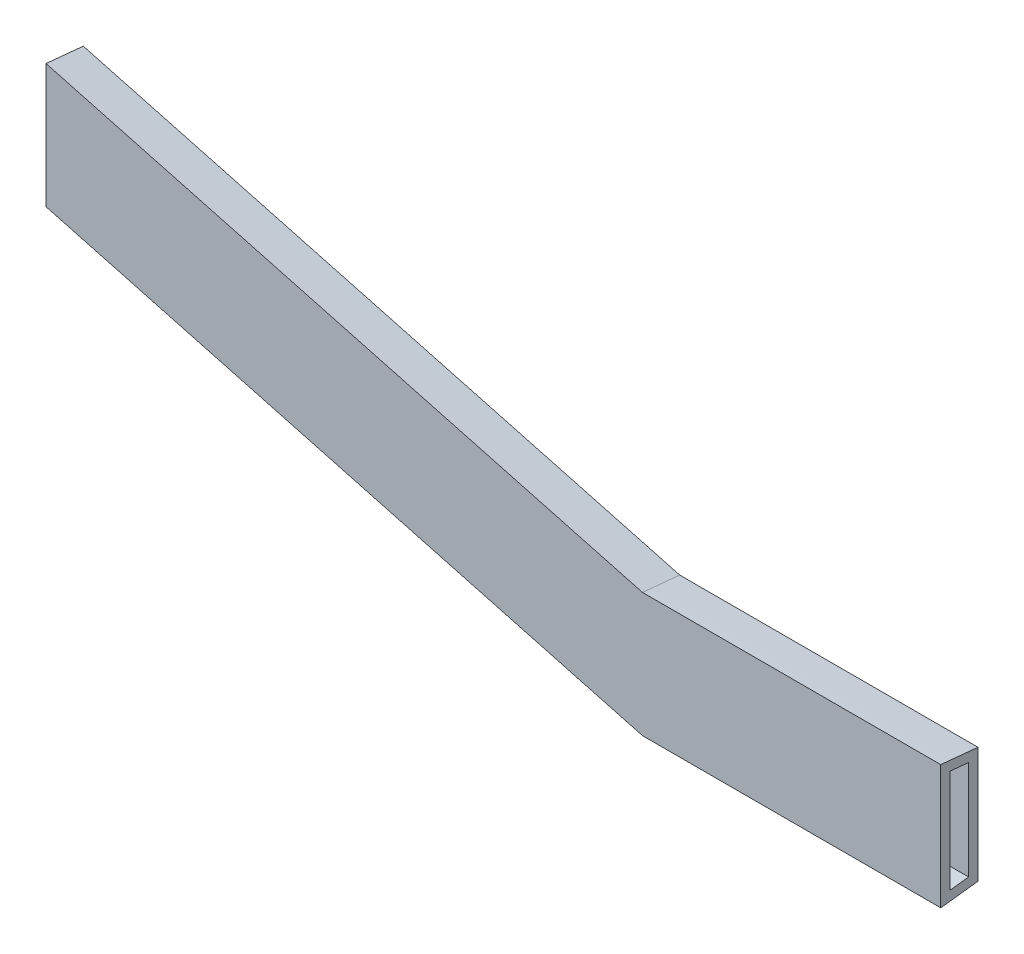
from build123d import *

# Parameters (mm, degrees)
BOSS_EXTRUDE1_DEPTH = 25.4
SKETCH4_W           = 22.696461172
SKETCH4_H           = 36.060709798
CUT_EXTRUDE1_DEPTH  = 107.554527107


with BuildPart() as part:
    # Sketch1 → Boss-Extrude1 (new body)
    with BuildSketch(Plane(origin=(0, 0, 0), x_dir=(0, 0, -1), z_dir=(1, 0, 0))):
        with BuildLine():
            Line((64.29375, 17.938061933), (64.29375, 7.373467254))
            add(Edge.make_bspline(
                [(64.29375, 7.373467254), (65.351478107, 7.504041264), (66.409826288, 7.629695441), (67.46875, 7.75018981)],
                knots=[0.728361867, 0.728361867, 0.728361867, 0.728361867, 0.738787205, 0.738787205, 0.738787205, 0.738787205], degree=3))
            Line((67.46875, 7.75018981), (67.46875, 17.629812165))
            add(Edge.make_bspline(
                [(67.46875, 17.629812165), (66.410784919, 17.736286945), (65.352462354, 17.839293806), (64.29375, 17.938061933)],
                knots=[1.266200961, 1.266200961, 1.266200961, 1.266200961, 1.276645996, 1.276645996, 1.276645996, 1.276645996], degree=3))
        make_face()
        with BuildLine():
            Line((65.09385, 17.058887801), (65.09385, 8.277208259))
            add(Edge.make_bspline(
                [(65.09385, 8.277208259), (65.618635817, 8.340583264), (66.143570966, 8.40273425), (66.66865, 8.463632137)],
                knots=[0.731305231, 0.731305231, 0.731305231, 0.731305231, 0.736463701, 0.736463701, 0.736463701, 0.736463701], degree=3))
            Line((66.66865, 8.463632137), (66.66865, 16.905642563))
            add(Edge.make_bspline(
                [(66.66865, 16.905642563), (66.143807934, 16.957653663), (65.61887595, 17.008766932), (65.09385, 17.058887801)],
                knots=[1.268574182, 1.268574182, 1.268574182, 1.268574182, 1.273764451, 1.273764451, 1.273764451, 1.273764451], degree=3))
        make_face(mode=Mode.SUBTRACT)
    boss_extrude1 = extrude(amount=BOSS_EXTRUDE1_DEPTH)

    # Sweep1: sweep along a path in Sketch2
    with BuildLine(Plane.XY.offset(-64.29375)) as sweep1_path:
        Line((25.4, 7.373467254), (76.2, 20.98528623))
    # Sketch3 → Sweep1 (sweep)
    with BuildSketch(Plane(origin=(25.4, 0, 0), x_dir=(0, 0, -1), z_dir=(1, 0, 0))):
        with BuildLine():
            Line((64.29375, 17.938061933), (64.29375, 7.373467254))
            add(Edge.make_bspline(
                [(64.29375, 7.373467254), (65.351478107, 7.504041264), (66.409826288, 7.629695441), (67.46875, 7.75018981)],
                knots=[0.728361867, 0.728361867, 0.728361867, 0.728361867, 0.738787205, 0.738787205, 0.738787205, 0.738787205], degree=3))
            Line((67.46875, 7.75018981), (67.46875, 17.629812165))
            add(Edge.make_bspline(
                [(67.46875, 17.629812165), (66.410784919, 17.736286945), (65.352462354, 17.839293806), (64.29375, 17.938061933)],
                knots=[1.266200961, 1.266200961, 1.266200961, 1.266200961, 1.276645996, 1.276645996, 1.276645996, 1.276645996], degree=3))
        make_face()
        with BuildLine():
            Line((65.09385, 17.058887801), (65.09385, 8.277208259))
            ThreePointArc((65.09385, 8.277208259), (65.881140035, 8.371349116), (66.66865, 8.463632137))
            Line((66.66865, 8.463632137), (66.66865, 16.905642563))
            ThreePointArc((66.66865, 16.905642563), (65.881318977, 16.982974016), (65.09385, 17.058887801))
        make_face(mode=Mode.SUBTRACT)
    sweep1 = sweep(path=sweep1_path.line)

    # Mirror1: Boss-Extrude1, Sweep1 across plane
    add(boss_extrude1.mirror(Plane(origin=(0, 0, 0), x_dir=(0, 0, 1), z_dir=(1, 0, 0))))
    add(sweep1.mirror(Plane(origin=(0, 0, 0), x_dir=(0, 0, 1), z_dir=(1, 0, 0))))

    # Sketch4 → Cut-Extrude1 (cut, through all)
    with BuildSketch(Plane(origin=(0, 0, 0), x_dir=(0, 0, -1), z_dir=(1, 0, 0))):
        with Locations((67.409521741, 20.013565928)):
            Rectangle(SKETCH4_W, SKETCH4_H)
    extrude(amount=CUT_EXTRUDE1_DEPTH, mode=Mode.SUBTRACT)


solid = part.part
